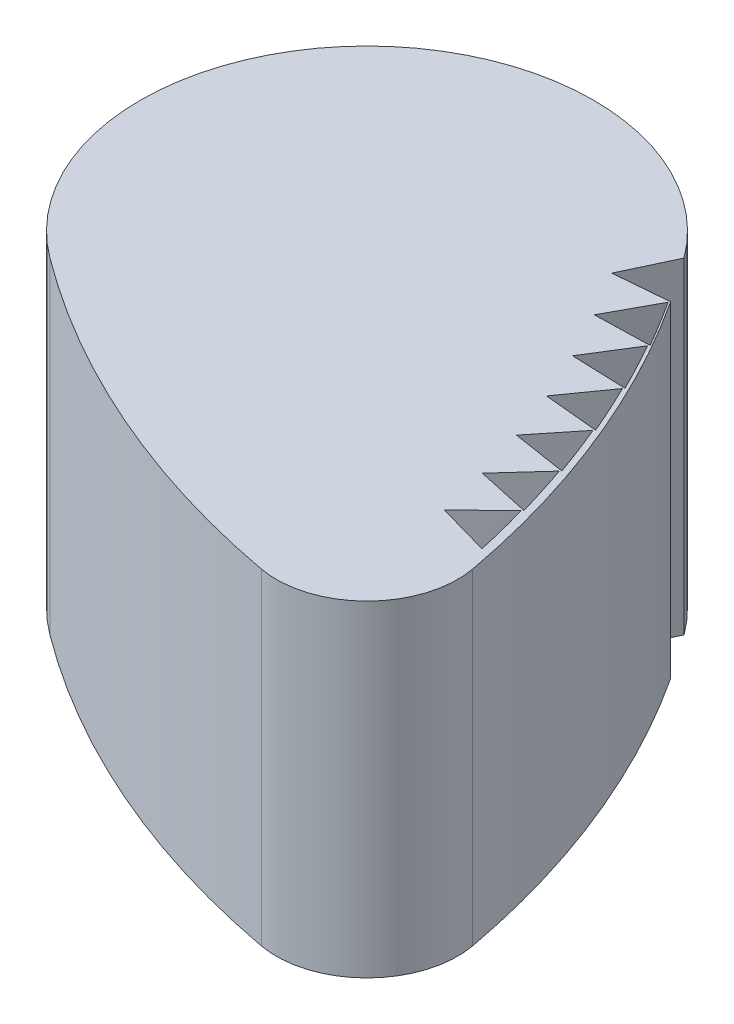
ISO-10303-21;
HEADER;
FILE_DESCRIPTION(('STEP AP214'),'2;1');
FILE_NAME('part.step','',(''),(''),'','','');
FILE_SCHEMA(('AUTOMOTIVE_DESIGN { 1 0 10303 214 1 1 1 1 }'));
ENDSEC;
DATA;
#1=APPLICATION_CONTEXT('core data for automotive mechanical design processes');
#2=APPLICATION_PROTOCOL_DEFINITION('international standard','automotive_design',2000,#1);
#3=PRODUCT_CONTEXT('',#1,'mechanical');
#4=PRODUCT('Part','Part','',(#3));
#5=PRODUCT_RELATED_PRODUCT_CATEGORY('part','',(#4));
#6=PRODUCT_DEFINITION_FORMATION('','',#4);
#7=PRODUCT_DEFINITION_CONTEXT('part definition',#1,'design');
#8=PRODUCT_DEFINITION('design','',#6,#7);
#9=PRODUCT_DEFINITION_SHAPE('','',#8);
#10=(LENGTH_UNIT() NAMED_UNIT(*) SI_UNIT(.MILLI.,.METRE.));
#11=(NAMED_UNIT(*) PLANE_ANGLE_UNIT() SI_UNIT($,.RADIAN.));
#12=(NAMED_UNIT(*) SI_UNIT($,.STERADIAN.) SOLID_ANGLE_UNIT());
#13=UNCERTAINTY_MEASURE_WITH_UNIT(LENGTH_MEASURE(1.E-05),#10,'distance_accuracy_value','');
#14=(GEOMETRIC_REPRESENTATION_CONTEXT(3) GLOBAL_UNCERTAINTY_ASSIGNED_CONTEXT((#13)) GLOBAL_UNIT_ASSIGNED_CONTEXT((#10,
#11,#12)) REPRESENTATION_CONTEXT('',''));
#15=CARTESIAN_POINT('',(0.,0.,0.));
#16=DIRECTION('',(0.,0.,1.));
#17=DIRECTION('',(1.,0.,0.));
#18=AXIS2_PLACEMENT_3D('',#15,#16,#17);
#19=CARTESIAN_POINT('',(22.3660307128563,18.,-30.1000111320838));
#20=DIRECTION('',(0.,-1.,0.));
#21=DIRECTION('',(0.,0.,-1.));
#22=AXIS2_PLACEMENT_3D('',#19,#20,#21);
#23=CYLINDRICAL_SURFACE('',#22,50.);
#24=CARTESIAN_POINT('',(22.3660307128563,0.,-30.1000111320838));
#25=DIRECTION('',(0.,1.,0.));
#26=DIRECTION('',(0.,0.,1.));
#27=AXIS2_PLACEMENT_3D('',#24,#25,#26);
#28=CIRCLE('',#27,50.);
#29=CARTESIAN_POINT('',(-7.45534357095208,0.,10.0333370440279));
#30=VERTEX_POINT('',#29);
#31=CARTESIAN_POINT('',(13.2283695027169,0.,19.0579297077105));
#32=VERTEX_POINT('',#31);
#33=EDGE_CURVE('E358',#30,#32,#28,.T.);
#34=ORIENTED_EDGE('',*,*,#33,.T.);
#35=DIRECTION('',(0.,-1.,0.));
#36=VECTOR('',#35,1.);
#37=CARTESIAN_POINT('',(13.2283695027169,18.,19.0579297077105));
#38=LINE('',#37,#36);
#39=CARTESIAN_POINT('',(13.2283695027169,18.,19.0579297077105));
#40=VERTEX_POINT('',#39);
#41=EDGE_CURVE('E12',#40,#32,#38,.T.);
#42=ORIENTED_EDGE('',*,*,#41,.F.);
#43=CARTESIAN_POINT('',(22.3660307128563,18.,-30.1000111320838));
#44=DIRECTION('',(0.,1.,0.));
#45=DIRECTION('',(0.,0.,1.));
#46=AXIS2_PLACEMENT_3D('',#43,#44,#45);
#47=CIRCLE('',#46,50.);
#48=CARTESIAN_POINT('',(-7.45534357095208,18.,10.0333370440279));
#49=VERTEX_POINT('',#48);
#50=EDGE_CURVE('E360',#49,#40,#47,.T.);
#51=ORIENTED_EDGE('',*,*,#50,.F.);
#52=DIRECTION('',(0.,-1.,0.));
#53=VECTOR('',#52,1.);
#54=CARTESIAN_POINT('',(-7.45534357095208,18.,10.0333370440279));
#55=LINE('',#54,#53);
#56=EDGE_CURVE('E371',#49,#30,#55,.T.);
#57=ORIENTED_EDGE('',*,*,#56,.T.);
#58=EDGE_LOOP('',(#34,#42,#51,#57));
#59=FACE_BOUND('',#58,.T.);
#60=ADVANCED_FACE('F36',(#59),#23,.T.);
#61=CARTESIAN_POINT('',(14.1421356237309,18.,14.142135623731));
#62=DIRECTION('',(0.,-1.,0.));
#63=DIRECTION('',(0.,0.,-1.));
#64=AXIS2_PLACEMENT_3D('',#61,#62,#63);
#65=CYLINDRICAL_SURFACE('',#64,5.);
#66=CARTESIAN_POINT('',(14.1421356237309,0.,14.142135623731));
#67=DIRECTION('',(0.,1.,0.));
#68=DIRECTION('',(0.,0.,1.));
#69=AXIS2_PLACEMENT_3D('',#66,#67,#68);
#70=CIRCLE('',#69,5.);
#71=CARTESIAN_POINT('',(19.0579297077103,0.,13.2283695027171));
#72=VERTEX_POINT('',#71);
#73=EDGE_CURVE('E374',#32,#72,#70,.T.);
#74=ORIENTED_EDGE('',*,*,#73,.T.);
#75=DIRECTION('',(0.,-1.,0.));
#76=VECTOR('',#75,1.);
#77=CARTESIAN_POINT('',(19.0579297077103,18.,13.2283695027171));
#78=LINE('',#77,#76);
#79=CARTESIAN_POINT('',(19.0579297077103,18.,13.2283695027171));
#80=VERTEX_POINT('',#79);
#81=EDGE_CURVE('E43',#80,#72,#78,.T.);
#82=ORIENTED_EDGE('',*,*,#81,.F.);
#83=CARTESIAN_POINT('',(14.1421356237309,18.,14.142135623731));
#84=DIRECTION('',(0.,1.,0.));
#85=DIRECTION('',(0.,0.,1.));
#86=AXIS2_PLACEMENT_3D('',#83,#84,#85);
#87=CIRCLE('',#86,5.);
#88=EDGE_CURVE('E363',#40,#80,#87,.T.);
#89=ORIENTED_EDGE('',*,*,#88,.F.);
#90=ORIENTED_EDGE('',*,*,#41,.T.);
#91=EDGE_LOOP('',(#74,#82,#89,#90));
#92=FACE_BOUND('',#91,.T.);
#93=ADVANCED_FACE('F406',(#92),#65,.T.);
#94=CARTESIAN_POINT('',(-30.1000111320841,18.,22.3660307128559));
#95=DIRECTION('',(0.,-1.,0.));
#96=DIRECTION('',(0.,0.,-1.));
#97=AXIS2_PLACEMENT_3D('',#94,#95,#96);
#98=CYLINDRICAL_SURFACE('',#97,50.);
#99=CARTESIAN_POINT('',(-30.1000111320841,0.,22.3660307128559));
#100=DIRECTION('',(0.,1.,0.));
#101=DIRECTION('',(0.,0.,-1.));
#102=AXIS2_PLACEMENT_3D('',#99,#100,#101);
#103=CIRCLE('',#102,50.);
#104=CARTESIAN_POINT('',(11.7495741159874,0.,-4.99474805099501));
#105=VERTEX_POINT('',#104);
#106=EDGE_CURVE('E376',#72,#105,#103,.T.);
#107=ORIENTED_EDGE('',*,*,#106,.T.);
#108=DIRECTION('',(0.,1.,0.));
#109=VECTOR('',#108,1.);
#110=CARTESIAN_POINT('',(11.7495741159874,0.,-4.99474805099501));
#111=LINE('',#110,#109);
#112=CARTESIAN_POINT('',(11.7495741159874,18.,-4.99474805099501));
#113=VERTEX_POINT('',#112);
#114=EDGE_CURVE('E355',#105,#113,#111,.T.);
#115=ORIENTED_EDGE('',*,*,#114,.T.);
#116=CARTESIAN_POINT('',(-30.1000111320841,18.,22.3660307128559));
#117=DIRECTION('',(0.,1.,0.));
#118=DIRECTION('',(0.,0.,-1.));
#119=AXIS2_PLACEMENT_3D('',#116,#117,#118);
#120=CIRCLE('',#119,50.);
#121=EDGE_CURVE('E366',#80,#113,#120,.T.);
#122=ORIENTED_EDGE('',*,*,#121,.F.);
#123=ORIENTED_EDGE('',*,*,#81,.T.);
#124=EDGE_LOOP('',(#107,#115,#122,#123));
#125=FACE_BOUND('',#124,.T.);
#126=ADVANCED_FACE('F389',(#125),#98,.T.);
#127=CARTESIAN_POINT('',(0.,18.,0.));
#128=DIRECTION('',(0.,-1.,0.));
#129=DIRECTION('',(0.,0.,-1.));
#130=AXIS2_PLACEMENT_3D('',#127,#128,#129);
#131=CYLINDRICAL_SURFACE('',#130,12.5);
#132=CARTESIAN_POINT('',(0.,0.,0.));
#133=DIRECTION('',(0.,1.,0.));
#134=DIRECTION('',(0.,0.,1.));
#135=AXIS2_PLACEMENT_3D('',#132,#133,#134);
#136=CIRCLE('',#135,12.5);
#137=CARTESIAN_POINT('',(10.033337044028,0.,-7.45534357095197));
#138=VERTEX_POINT('',#137);
#139=EDGE_CURVE('E364',#138,#30,#136,.T.);
#140=ORIENTED_EDGE('',*,*,#139,.T.);
#141=ORIENTED_EDGE('',*,*,#56,.F.);
#142=CARTESIAN_POINT('',(0.,18.,0.));
#143=DIRECTION('',(0.,1.,0.));
#144=DIRECTION('',(0.,0.,1.));
#145=AXIS2_PLACEMENT_3D('',#142,#143,#144);
#146=CIRCLE('',#145,12.5);
#147=CARTESIAN_POINT('',(10.033337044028,18.,-7.45534357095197));
#148=VERTEX_POINT('',#147);
#149=EDGE_CURVE('E369',#148,#49,#146,.T.);
#150=ORIENTED_EDGE('',*,*,#149,.F.);
#151=DIRECTION('',(0.,-1.,0.));
#152=VECTOR('',#151,1.);
#153=CARTESIAN_POINT('',(10.033337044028,18.,-7.45534357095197));
#154=LINE('',#153,#152);
#155=EDGE_CURVE('E382',#148,#138,#154,.T.);
#156=ORIENTED_EDGE('',*,*,#155,.T.);
#157=EDGE_LOOP('',(#140,#141,#150,#156));
#158=FACE_BOUND('',#157,.T.);
#159=ADVANCED_FACE('F410',(#158),#131,.T.);
#160=CARTESIAN_POINT('',(18.2540831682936,18.,-7.97893775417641));
#161=DIRECTION('',(0.,1.,0.));
#162=DIRECTION('',(0.,0.,1.));
#163=AXIS2_PLACEMENT_3D('',#160,#161,#162);
#164=PLANE('',#163);
#165=CARTESIAN_POINT('',(-30.4609140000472,18.,22.8681883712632));
#166=DIRECTION('',(0.,1.,0.));
#167=DIRECTION('',(-0.352274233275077,0.,0.93589682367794));
#168=AXIS2_PLACEMENT_3D('',#165,#166,#167);
#169=CIRCLE('',#168,50.);
#170=CARTESIAN_POINT('',(18.3444772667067,18.,12.0038529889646));
#171=VERTEX_POINT('',#170);
#172=CARTESIAN_POINT('',(17.6050608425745,18.,9.096403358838));
#173=VERTEX_POINT('',#172);
#174=EDGE_CURVE('E50',#171,#173,#169,.T.);
#175=ORIENTED_EDGE('',*,*,#174,.F.);
#176=DIRECTION('',(0.962544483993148,0.,0.271123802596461));
#177=VECTOR('',#176,1.);
#178=CARTESIAN_POINT('',(15.4568438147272,18.,11.1904815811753));
#179=LINE('',#178,#177);
#180=CARTESIAN_POINT('',(15.4568438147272,18.,11.1904815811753));
#181=VERTEX_POINT('',#180);
#182=EDGE_CURVE('E211',#181,#171,#179,.T.);
#183=ORIENTED_EDGE('',*,*,#182,.F.);
#184=DIRECTION('',(-0.716072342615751,0.,0.698026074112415));
#185=VECTOR('',#184,1.);
#186=CARTESIAN_POINT('',(17.6050608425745,18.,9.09640335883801));
#187=LINE('',#186,#185);
#188=EDGE_CURVE('E214',#173,#181,#187,.T.);
#189=ORIENTED_EDGE('',*,*,#188,.F.);
#190=EDGE_LOOP('',(#175,#183,#189));
#191=FACE_BOUND('',#190,.T.);
#192=CARTESIAN_POINT('',(-30.3885527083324,18.,22.794035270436));
#193=DIRECTION('',(0.,1.,0.));
#194=DIRECTION('',(-0.295520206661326,0.,0.95533648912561));
#195=AXIS2_PLACEMENT_3D('',#192,#193,#194);
#196=CIRCLE('',#195,50.);
#197=CARTESIAN_POINT('',(17.6775461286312,18.,9.02268302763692));
#198=VERTEX_POINT('',#197);
#199=CARTESIAN_POINT('',(16.7651179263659,18.,6.16480360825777));
#200=VERTEX_POINT('',#199);
#201=EDGE_CURVE('E222',#198,#200,#196,.T.);
#202=ORIENTED_EDGE('',*,*,#201,.F.);
#203=DIRECTION('',(0.977070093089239,0.,0.212917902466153));
#204=VECTOR('',#203,1.);
#205=CARTESIAN_POINT('',(14.7463358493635,18.,8.38392932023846));
#206=LINE('',#205,#204);
#207=CARTESIAN_POINT('',(14.7463358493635,18.,8.38392932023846));
#208=VERTEX_POINT('',#207);
#209=EDGE_CURVE('E228',#208,#198,#206,.T.);
#210=ORIENTED_EDGE('',*,*,#209,.F.);
#211=DIRECTION('',(-0.67292735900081,0.,0.739708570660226));
#212=VECTOR('',#211,1.);
#213=CARTESIAN_POINT('',(16.7651179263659,18.,6.16480360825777));
#214=LINE('',#213,#212);
#215=EDGE_CURVE('E236',#200,#208,#214,.T.);
#216=ORIENTED_EDGE('',*,*,#215,.F.);
#217=EDGE_LOOP('',(#202,#210,#216));
#218=FACE_BOUND('',#217,.T.);
#219=CARTESIAN_POINT('',(-30.3207681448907,18.,22.7156765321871));
#220=DIRECTION('',(0.,1.,0.));
#221=DIRECTION('',(-0.237702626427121,0.,0.971337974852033));
#222=AXIS2_PLACEMENT_3D('',#219,#220,#221);
#223=CIRCLE('',#222,50.);
#224=CARTESIAN_POINT('',(16.8330522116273,18.,6.08686942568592));
#225=VERTEX_POINT('',#224);
#226=CARTESIAN_POINT('',(15.7508959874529,18.,3.2888454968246));
#227=VERTEX_POINT('',#226);
#228=EDGE_CURVE('E243',#225,#227,#223,.T.);
#229=ORIENTED_EDGE('',*,*,#228,.F.);
#230=DIRECTION('',(0.988079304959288,0.,0.153945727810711));
#231=VECTOR('',#230,1.);
#232=CARTESIAN_POINT('',(13.8688142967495,18.,5.62503224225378));
#233=LINE('',#232,#231);
#234=CARTESIAN_POINT('',(13.8688142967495,18.,5.62503224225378));
#235=VERTEX_POINT('',#234);
#236=EDGE_CURVE('E252',#235,#225,#233,.T.);
#237=ORIENTED_EDGE('',*,*,#236,.F.);
#238=DIRECTION('',(-0.62736056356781,0.,0.778728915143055));
#239=VECTOR('',#238,1.);
#240=CARTESIAN_POINT('',(15.7508959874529,18.,3.2888454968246));
#241=LINE('',#240,#239);
#242=EDGE_CURVE('E260',#227,#235,#241,.T.);
#243=ORIENTED_EDGE('',*,*,#242,.F.);
#244=EDGE_LOOP('',(#229,#237,#243));
#245=FACE_BOUND('',#244,.T.);
#246=CARTESIAN_POINT('',(-30.257804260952,18.,22.633394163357));
#247=DIRECTION('',(0.,1.,0.));
#248=DIRECTION('',(-0.17902957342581,0.,0.983843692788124));
#249=AXIS2_PLACEMENT_3D('',#246,#247,#248);
#250=CIRCLE('',#249,50.);
#251=CARTESIAN_POINT('',(15.8140347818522,18.,3.20697794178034));
#252=VERTEX_POINT('',#251);
#253=CARTESIAN_POINT('',(14.5660451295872,18.,0.478879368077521));
#254=VERTEX_POINT('',#253);
#255=EDGE_CURVE('E267',#252,#254,#250,.T.);
#256=ORIENTED_EDGE('',*,*,#255,.F.);
#257=DIRECTION('',(0.995532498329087,0.,0.0944195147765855));
#258=VECTOR('',#257,1.);
#259=CARTESIAN_POINT('',(12.8274372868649,18.,2.92371939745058));
#260=LINE('',#259,#258);
#261=CARTESIAN_POINT('',(12.8274372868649,18.,2.92371939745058));
#262=VERTEX_POINT('',#261);
#263=EDGE_CURVE('E276',#262,#252,#260,.T.);
#264=ORIENTED_EDGE('',*,*,#263,.F.);
#265=DIRECTION('',(-0.579535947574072,0.,0.814946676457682));
#266=VECTOR('',#265,1.);
#267=CARTESIAN_POINT('',(14.5660451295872,18.,0.478879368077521));
#268=LINE('',#267,#266);
#269=EDGE_CURVE('E284',#254,#262,#268,.T.);
#270=ORIENTED_EDGE('',*,*,#269,.F.);
#271=EDGE_LOOP('',(#256,#264,#270));
#272=FACE_BOUND('',#271,.T.);
#273=CARTESIAN_POINT('',(-30.1998876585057,18.,22.5474842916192));
#274=DIRECTION('',(0.,1.,0.));
#275=DIRECTION('',(-0.119712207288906,0.,0.992808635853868));
#276=AXIS2_PLACEMENT_3D('',#273,#274,#275);
#277=CIRCLE('',#276,50.);
#278=CARTESIAN_POINT('',(14.6241612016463,18.,0.393373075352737));
#279=VERTEX_POINT('',#278);
#280=CARTESIAN_POINT('',(13.2148295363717,18.,-2.25498193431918));
#281=VERTEX_POINT('',#280);
#282=EDGE_CURVE('E291',#279,#281,#277,.T.);
#283=ORIENTED_EDGE('',*,*,#282,.F.);
#284=DIRECTION('',(0.999402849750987,0.,0.034553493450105));
#285=VECTOR('',#284,1.);
#286=CARTESIAN_POINT('',(11.6259526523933,18.,0.289712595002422));
#287=LINE('',#286,#285);
#288=CARTESIAN_POINT('',(11.6259526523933,18.,0.289712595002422));
#289=VERTEX_POINT('',#288);
#290=EDGE_CURVE('E300',#289,#279,#287,.T.);
#291=ORIENTED_EDGE('',*,*,#290,.F.);
#292=DIRECTION('',(-0.529625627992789,0.,0.848231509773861));
#293=VECTOR('',#292,1.);
#294=CARTESIAN_POINT('',(13.2148295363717,18.,-2.25498193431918));
#295=LINE('',#294,#293);
#296=EDGE_CURVE('E308',#281,#289,#295,.T.);
#297=ORIENTED_EDGE('',*,*,#296,.F.);
#298=EDGE_LOOP('',(#283,#291,#297));
#299=FACE_BOUND('',#298,.T.);
#300=CARTESIAN_POINT('',(-30.1472267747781,18.,22.4582560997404));
#301=DIRECTION('',(0.,1.,0.));
#302=DIRECTION('',(-0.0599640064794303,0.,0.998200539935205));
#303=AXIS2_PLACEMENT_3D('',#300,#301,#302);
#304=CIRCLE('',#303,50.);
#305=CARTESIAN_POINT('',(13.2677137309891,18.,-2.34381923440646));
#306=VERTEX_POINT('',#305);
#307=CARTESIAN_POINT('',(11.7021121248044,18.,-4.90289946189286));
#308=VERTEX_POINT('',#307);
#309=EDGE_CURVE('E315',#306,#308,#304,.T.);
#310=ORIENTED_EDGE('',*,*,#309,.F.);
#311=DIRECTION('',(0.999676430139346,0.,-0.0254368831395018));
#312=VECTOR('',#311,1.);
#313=CARTESIAN_POINT('',(10.268684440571,18.,-2.26750858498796));
#314=LINE('',#313,#312);
#315=CARTESIAN_POINT('',(10.268684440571,18.,-2.26750858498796));
#316=VERTEX_POINT('',#315);
#317=EDGE_CURVE('E324',#316,#306,#314,.T.);
#318=ORIENTED_EDGE('',*,*,#317,.F.);
#319=DIRECTION('',(-0.477809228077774,0.,0.878463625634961));
#320=VECTOR('',#319,1.);
#321=CARTESIAN_POINT('',(11.7021121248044,18.,-4.90289946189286));
#322=LINE('',#321,#320);
#323=EDGE_CURVE('E332',#308,#316,#322,.T.);
#324=ORIENTED_EDGE('',*,*,#323,.F.);
#325=EDGE_LOOP('',(#310,#318,#324));
#326=FACE_BOUND('',#325,.T.);
#327=DIRECTION('',(0.9963522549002,0.,-0.0853357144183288));
#328=VECTOR('',#327,1.);
#329=CARTESIAN_POINT('',(8.76051735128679,18.,-4.73874090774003));
#330=LINE('',#329,#328);
#331=CARTESIAN_POINT('',(8.76051735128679,18.,-4.73874090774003));
#332=VERTEX_POINT('',#331);
#333=EDGE_CURVE('E348',#332,#113,#330,.T.);
#334=ORIENTED_EDGE('',*,*,#333,.F.);
#335=DIRECTION('',(-0.424273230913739,0.,0.905534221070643));
#336=VECTOR('',#335,1.);
#337=CARTESIAN_POINT('',(10.033337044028,18.,-7.45534357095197));
#338=LINE('',#337,#336);
#339=EDGE_CURVE('E339',#148,#332,#338,.T.);
#340=ORIENTED_EDGE('',*,*,#339,.F.);
#341=ORIENTED_EDGE('',*,*,#149,.T.);
#342=ORIENTED_EDGE('',*,*,#50,.T.);
#343=ORIENTED_EDGE('',*,*,#88,.T.);
#344=ORIENTED_EDGE('',*,*,#121,.T.);
#345=EDGE_LOOP('',(#334,#340,#341,#342,#343,#344));
#346=FACE_BOUND('',#345,.T.);
#347=ADVANCED_FACE('F403',(#191,#218,#245,#272,#299,#326,#346),#164,.T.);
#348=CARTESIAN_POINT('',(18.2540831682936,0.,-7.97893775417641));
#349=DIRECTION('',(0.,1.,0.));
#350=DIRECTION('',(0.,0.,1.));
#351=AXIS2_PLACEMENT_3D('',#348,#349,#350);
#352=PLANE('',#351);
#353=DIRECTION('',(0.962544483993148,0.,0.271123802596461));
#354=VECTOR('',#353,1.);
#355=CARTESIAN_POINT('',(15.4568438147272,0.,11.1904815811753));
#356=LINE('',#355,#354);
#357=CARTESIAN_POINT('',(15.4568438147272,0.,11.1904815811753));
#358=VERTEX_POINT('',#357);
#359=CARTESIAN_POINT('',(18.3444772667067,0.,12.0038529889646));
#360=VERTEX_POINT('',#359);
#361=EDGE_CURVE('E58',#358,#360,#356,.T.);
#362=ORIENTED_EDGE('',*,*,#361,.T.);
#363=CARTESIAN_POINT('',(-30.4609140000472,0.,22.8681883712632));
#364=DIRECTION('',(0.,1.,0.));
#365=DIRECTION('',(-0.352274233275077,0.,0.93589682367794));
#366=AXIS2_PLACEMENT_3D('',#363,#364,#365);
#367=CIRCLE('',#366,50.);
#368=CARTESIAN_POINT('',(17.6050608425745,0.,9.09640335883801));
#369=VERTEX_POINT('',#368);
#370=EDGE_CURVE('E198',#360,#369,#367,.T.);
#371=ORIENTED_EDGE('',*,*,#370,.T.);
#372=DIRECTION('',(-0.716072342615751,0.,0.698026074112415));
#373=VECTOR('',#372,1.);
#374=CARTESIAN_POINT('',(17.6050608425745,0.,9.09640335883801));
#375=LINE('',#374,#373);
#376=EDGE_CURVE('E205',#369,#358,#375,.T.);
#377=ORIENTED_EDGE('',*,*,#376,.T.);
#378=EDGE_LOOP('',(#362,#371,#377));
#379=FACE_BOUND('',#378,.T.);
#380=DIRECTION('',(0.977070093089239,0.,0.212917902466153));
#381=VECTOR('',#380,1.);
#382=CARTESIAN_POINT('',(14.7463358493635,0.,8.38392932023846));
#383=LINE('',#382,#381);
#384=CARTESIAN_POINT('',(14.7463358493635,0.,8.38392932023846));
#385=VERTEX_POINT('',#384);
#386=CARTESIAN_POINT('',(17.6775461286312,0.,9.02268302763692));
#387=VERTEX_POINT('',#386);
#388=EDGE_CURVE('E231',#385,#387,#383,.T.);
#389=ORIENTED_EDGE('',*,*,#388,.T.);
#390=CARTESIAN_POINT('',(-30.3885527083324,0.,22.794035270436));
#391=DIRECTION('',(0.,1.,0.));
#392=DIRECTION('',(-0.295520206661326,0.,0.95533648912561));
#393=AXIS2_PLACEMENT_3D('',#390,#391,#392);
#394=CIRCLE('',#393,50.);
#395=CARTESIAN_POINT('',(16.7651179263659,0.,6.16480360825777));
#396=VERTEX_POINT('',#395);
#397=EDGE_CURVE('E224',#387,#396,#394,.T.);
#398=ORIENTED_EDGE('',*,*,#397,.T.);
#399=DIRECTION('',(-0.67292735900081,0.,0.739708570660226));
#400=VECTOR('',#399,1.);
#401=CARTESIAN_POINT('',(16.7651179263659,0.,6.16480360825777));
#402=LINE('',#401,#400);
#403=EDGE_CURVE('E227',#396,#385,#402,.T.);
#404=ORIENTED_EDGE('',*,*,#403,.T.);
#405=EDGE_LOOP('',(#389,#398,#404));
#406=FACE_BOUND('',#405,.T.);
#407=DIRECTION('',(0.988079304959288,0.,0.153945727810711));
#408=VECTOR('',#407,1.);
#409=CARTESIAN_POINT('',(13.8688142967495,0.,5.62503224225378));
#410=LINE('',#409,#408);
#411=CARTESIAN_POINT('',(13.8688142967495,0.,5.62503224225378));
#412=VERTEX_POINT('',#411);
#413=CARTESIAN_POINT('',(16.8330522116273,0.,6.08686942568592));
#414=VERTEX_POINT('',#413);
#415=EDGE_CURVE('E255',#412,#414,#410,.T.);
#416=ORIENTED_EDGE('',*,*,#415,.T.);
#417=CARTESIAN_POINT('',(-30.3207681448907,0.,22.7156765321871));
#418=DIRECTION('',(0.,1.,0.));
#419=DIRECTION('',(-0.237702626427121,0.,0.971337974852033));
#420=AXIS2_PLACEMENT_3D('',#417,#418,#419);
#421=CIRCLE('',#420,50.);
#422=CARTESIAN_POINT('',(15.7508959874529,0.,3.2888454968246));
#423=VERTEX_POINT('',#422);
#424=EDGE_CURVE('E248',#414,#423,#421,.T.);
#425=ORIENTED_EDGE('',*,*,#424,.T.);
#426=DIRECTION('',(-0.62736056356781,0.,0.778728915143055));
#427=VECTOR('',#426,1.);
#428=CARTESIAN_POINT('',(15.7508959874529,0.,3.2888454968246));
#429=LINE('',#428,#427);
#430=EDGE_CURVE('E251',#423,#412,#429,.T.);
#431=ORIENTED_EDGE('',*,*,#430,.T.);
#432=EDGE_LOOP('',(#416,#425,#431));
#433=FACE_BOUND('',#432,.T.);
#434=DIRECTION('',(0.995532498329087,0.,0.0944195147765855));
#435=VECTOR('',#434,1.);
#436=CARTESIAN_POINT('',(12.8274372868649,0.,2.92371939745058));
#437=LINE('',#436,#435);
#438=CARTESIAN_POINT('',(12.8274372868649,0.,2.92371939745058));
#439=VERTEX_POINT('',#438);
#440=CARTESIAN_POINT('',(15.8140347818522,0.,3.20697794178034));
#441=VERTEX_POINT('',#440);
#442=EDGE_CURVE('E279',#439,#441,#437,.T.);
#443=ORIENTED_EDGE('',*,*,#442,.T.);
#444=CARTESIAN_POINT('',(-30.257804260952,0.,22.633394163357));
#445=DIRECTION('',(0.,1.,0.));
#446=DIRECTION('',(-0.17902957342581,0.,0.983843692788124));
#447=AXIS2_PLACEMENT_3D('',#444,#445,#446);
#448=CIRCLE('',#447,50.);
#449=CARTESIAN_POINT('',(14.5660451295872,0.,0.478879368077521));
#450=VERTEX_POINT('',#449);
#451=EDGE_CURVE('E272',#441,#450,#448,.T.);
#452=ORIENTED_EDGE('',*,*,#451,.T.);
#453=DIRECTION('',(-0.579535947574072,0.,0.814946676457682));
#454=VECTOR('',#453,1.);
#455=CARTESIAN_POINT('',(14.5660451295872,0.,0.478879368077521));
#456=LINE('',#455,#454);
#457=EDGE_CURVE('E275',#450,#439,#456,.T.);
#458=ORIENTED_EDGE('',*,*,#457,.T.);
#459=EDGE_LOOP('',(#443,#452,#458));
#460=FACE_BOUND('',#459,.T.);
#461=DIRECTION('',(0.999402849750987,0.,0.034553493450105));
#462=VECTOR('',#461,1.);
#463=CARTESIAN_POINT('',(11.6259526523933,0.,0.289712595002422));
#464=LINE('',#463,#462);
#465=CARTESIAN_POINT('',(11.6259526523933,0.,0.289712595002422));
#466=VERTEX_POINT('',#465);
#467=CARTESIAN_POINT('',(14.6241612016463,0.,0.393373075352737));
#468=VERTEX_POINT('',#467);
#469=EDGE_CURVE('E303',#466,#468,#464,.T.);
#470=ORIENTED_EDGE('',*,*,#469,.T.);
#471=CARTESIAN_POINT('',(-30.1998876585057,0.,22.5474842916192));
#472=DIRECTION('',(0.,1.,0.));
#473=DIRECTION('',(-0.119712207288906,0.,0.992808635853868));
#474=AXIS2_PLACEMENT_3D('',#471,#472,#473);
#475=CIRCLE('',#474,50.);
#476=CARTESIAN_POINT('',(13.2148295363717,0.,-2.25498193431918));
#477=VERTEX_POINT('',#476);
#478=EDGE_CURVE('E296',#468,#477,#475,.T.);
#479=ORIENTED_EDGE('',*,*,#478,.T.);
#480=DIRECTION('',(-0.529625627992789,0.,0.848231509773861));
#481=VECTOR('',#480,1.);
#482=CARTESIAN_POINT('',(13.2148295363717,0.,-2.25498193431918));
#483=LINE('',#482,#481);
#484=EDGE_CURVE('E299',#477,#466,#483,.T.);
#485=ORIENTED_EDGE('',*,*,#484,.T.);
#486=EDGE_LOOP('',(#470,#479,#485));
#487=FACE_BOUND('',#486,.T.);
#488=DIRECTION('',(0.999676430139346,0.,-0.0254368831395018));
#489=VECTOR('',#488,1.);
#490=CARTESIAN_POINT('',(10.268684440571,0.,-2.26750858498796));
#491=LINE('',#490,#489);
#492=CARTESIAN_POINT('',(10.268684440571,0.,-2.26750858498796));
#493=VERTEX_POINT('',#492);
#494=CARTESIAN_POINT('',(13.2677137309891,0.,-2.34381923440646));
#495=VERTEX_POINT('',#494);
#496=EDGE_CURVE('E327',#493,#495,#491,.T.);
#497=ORIENTED_EDGE('',*,*,#496,.T.);
#498=CARTESIAN_POINT('',(-30.1472267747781,0.,22.4582560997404));
#499=DIRECTION('',(0.,1.,0.));
#500=DIRECTION('',(-0.0599640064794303,0.,0.998200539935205));
#501=AXIS2_PLACEMENT_3D('',#498,#499,#500);
#502=CIRCLE('',#501,50.);
#503=CARTESIAN_POINT('',(11.7021121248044,0.,-4.90289946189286));
#504=VERTEX_POINT('',#503);
#505=EDGE_CURVE('E320',#495,#504,#502,.T.);
#506=ORIENTED_EDGE('',*,*,#505,.T.);
#507=DIRECTION('',(-0.477809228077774,0.,0.878463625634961));
#508=VECTOR('',#507,1.);
#509=CARTESIAN_POINT('',(11.7021121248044,0.,-4.90289946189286));
#510=LINE('',#509,#508);
#511=EDGE_CURVE('E323',#504,#493,#510,.T.);
#512=ORIENTED_EDGE('',*,*,#511,.T.);
#513=EDGE_LOOP('',(#497,#506,#512));
#514=FACE_BOUND('',#513,.T.);
#515=DIRECTION('',(-0.424273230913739,0.,0.905534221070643));
#516=VECTOR('',#515,1.);
#517=CARTESIAN_POINT('',(10.033337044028,0.,-7.45534357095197));
#518=LINE('',#517,#516);
#519=CARTESIAN_POINT('',(8.76051735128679,0.,-4.73874090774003));
#520=VERTEX_POINT('',#519);
#521=EDGE_CURVE('E344',#138,#520,#518,.T.);
#522=ORIENTED_EDGE('',*,*,#521,.T.);
#523=DIRECTION('',(0.9963522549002,0.,-0.0853357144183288));
#524=VECTOR('',#523,1.);
#525=CARTESIAN_POINT('',(8.76051735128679,0.,-4.73874090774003));
#526=LINE('',#525,#524);
#527=EDGE_CURVE('E347',#520,#105,#526,.T.);
#528=ORIENTED_EDGE('',*,*,#527,.T.);
#529=ORIENTED_EDGE('',*,*,#106,.F.);
#530=ORIENTED_EDGE('',*,*,#73,.F.);
#531=ORIENTED_EDGE('',*,*,#33,.F.);
#532=ORIENTED_EDGE('',*,*,#139,.F.);
#533=EDGE_LOOP('',(#522,#528,#529,#530,#531,#532));
#534=FACE_BOUND('',#533,.T.);
#535=ADVANCED_FACE('F209',(#379,#406,#433,#460,#487,#514,#534),#352,.F.);
#536=CARTESIAN_POINT('',(8.76051735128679,0.,-4.73874090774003));
#537=DIRECTION('',(0.0853357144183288,0.,0.9963522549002));
#538=DIRECTION('',(0.9963522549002,0.,-0.0853357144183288));
#539=AXIS2_PLACEMENT_3D('',#536,#537,#538);
#540=PLANE('',#539);
#541=ORIENTED_EDGE('',*,*,#333,.T.);
#542=ORIENTED_EDGE('',*,*,#114,.F.);
#543=ORIENTED_EDGE('',*,*,#527,.F.);
#544=DIRECTION('',(0.,1.,0.));
#545=VECTOR('',#544,1.);
#546=CARTESIAN_POINT('',(8.76051735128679,0.,-4.73874090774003));
#547=LINE('',#546,#545);
#548=EDGE_CURVE('E351',#520,#332,#547,.T.);
#549=ORIENTED_EDGE('',*,*,#548,.T.);
#550=EDGE_LOOP('',(#541,#542,#543,#549));
#551=FACE_BOUND('',#550,.T.);
#552=ADVANCED_FACE('F396',(#551),#540,.F.);
#553=CARTESIAN_POINT('',(10.033337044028,0.,-7.45534357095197));
#554=DIRECTION('',(-0.905534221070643,0.,-0.424273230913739));
#555=DIRECTION('',(-0.424273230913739,0.,0.905534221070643));
#556=AXIS2_PLACEMENT_3D('',#553,#554,#555);
#557=PLANE('',#556);
#558=ORIENTED_EDGE('',*,*,#339,.T.);
#559=ORIENTED_EDGE('',*,*,#548,.F.);
#560=ORIENTED_EDGE('',*,*,#521,.F.);
#561=ORIENTED_EDGE('',*,*,#155,.F.);
#562=EDGE_LOOP('',(#558,#559,#560,#561));
#563=FACE_BOUND('',#562,.T.);
#564=ADVANCED_FACE('F398',(#563),#557,.F.);
#565=CARTESIAN_POINT('',(-30.1472267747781,0.,22.4582560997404));
#566=DIRECTION('',(0.,1.,0.));
#567=DIRECTION('',(0.,0.,1.));
#568=AXIS2_PLACEMENT_3D('',#565,#566,#567);
#569=CYLINDRICAL_SURFACE('',#568,50.);
#570=ORIENTED_EDGE('',*,*,#309,.T.);
#571=DIRECTION('',(0.,1.,0.));
#572=VECTOR('',#571,1.);
#573=CARTESIAN_POINT('',(11.7021121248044,0.,-4.90289946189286));
#574=LINE('',#573,#572);
#575=EDGE_CURVE('E330',#504,#308,#574,.T.);
#576=ORIENTED_EDGE('',*,*,#575,.F.);
#577=ORIENTED_EDGE('',*,*,#505,.F.);
#578=DIRECTION('',(0.,1.,0.));
#579=VECTOR('',#578,1.);
#580=CARTESIAN_POINT('',(13.2677137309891,0.,-2.34381923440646));
#581=LINE('',#580,#579);
#582=EDGE_CURVE('E337',#495,#306,#581,.T.);
#583=ORIENTED_EDGE('',*,*,#582,.T.);
#584=EDGE_LOOP('',(#570,#576,#577,#583));
#585=FACE_BOUND('',#584,.T.);
#586=ADVANCED_FACE('F455',(#585),#569,.F.);
#587=CARTESIAN_POINT('',(10.268684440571,0.,-2.26750858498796));
#588=DIRECTION('',(0.0254368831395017,0.,0.999676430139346));
#589=DIRECTION('',(0.999676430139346,0.,-0.0254368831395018));
#590=AXIS2_PLACEMENT_3D('',#587,#588,#589);
#591=PLANE('',#590);
#592=ORIENTED_EDGE('',*,*,#317,.T.);
#593=ORIENTED_EDGE('',*,*,#582,.F.);
#594=ORIENTED_EDGE('',*,*,#496,.F.);
#595=DIRECTION('',(0.,1.,0.));
#596=VECTOR('',#595,1.);
#597=CARTESIAN_POINT('',(10.268684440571,0.,-2.26750858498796));
#598=LINE('',#597,#596);
#599=EDGE_CURVE('E340',#493,#316,#598,.T.);
#600=ORIENTED_EDGE('',*,*,#599,.T.);
#601=EDGE_LOOP('',(#592,#593,#594,#600));
#602=FACE_BOUND('',#601,.T.);
#603=ADVANCED_FACE('F470',(#602),#591,.F.);
#604=CARTESIAN_POINT('',(11.7021121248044,0.,-4.90289946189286));
#605=DIRECTION('',(-0.878463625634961,0.,-0.477809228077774));
#606=DIRECTION('',(-0.477809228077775,0.,0.878463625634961));
#607=AXIS2_PLACEMENT_3D('',#604,#605,#606);
#608=PLANE('',#607);
#609=ORIENTED_EDGE('',*,*,#323,.T.);
#610=ORIENTED_EDGE('',*,*,#599,.F.);
#611=ORIENTED_EDGE('',*,*,#511,.F.);
#612=ORIENTED_EDGE('',*,*,#575,.T.);
#613=EDGE_LOOP('',(#609,#610,#611,#612));
#614=FACE_BOUND('',#613,.T.);
#615=ADVANCED_FACE('F480',(#614),#608,.F.);
#616=CARTESIAN_POINT('',(-30.1998876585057,0.,22.5474842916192));
#617=DIRECTION('',(0.,1.,0.));
#618=DIRECTION('',(0.,0.,1.));
#619=AXIS2_PLACEMENT_3D('',#616,#617,#618);
#620=CYLINDRICAL_SURFACE('',#619,50.);
#621=ORIENTED_EDGE('',*,*,#282,.T.);
#622=DIRECTION('',(0.,1.,0.));
#623=VECTOR('',#622,1.);
#624=CARTESIAN_POINT('',(13.2148295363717,0.,-2.25498193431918));
#625=LINE('',#624,#623);
#626=EDGE_CURVE('E306',#477,#281,#625,.T.);
#627=ORIENTED_EDGE('',*,*,#626,.F.);
#628=ORIENTED_EDGE('',*,*,#478,.F.);
#629=DIRECTION('',(0.,1.,0.));
#630=VECTOR('',#629,1.);
#631=CARTESIAN_POINT('',(14.6241612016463,0.,0.393373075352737));
#632=LINE('',#631,#630);
#633=EDGE_CURVE('E313',#468,#279,#632,.T.);
#634=ORIENTED_EDGE('',*,*,#633,.T.);
#635=EDGE_LOOP('',(#621,#627,#628,#634));
#636=FACE_BOUND('',#635,.T.);
#637=ADVANCED_FACE('F490',(#636),#620,.F.);
#638=CARTESIAN_POINT('',(11.6259526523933,0.,0.289712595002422));
#639=DIRECTION('',(-0.034553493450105,0.,0.999402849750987));
#640=DIRECTION('',(0.999402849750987,0.,0.034553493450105));
#641=AXIS2_PLACEMENT_3D('',#638,#639,#640);
#642=PLANE('',#641);
#643=ORIENTED_EDGE('',*,*,#290,.T.);
#644=ORIENTED_EDGE('',*,*,#633,.F.);
#645=ORIENTED_EDGE('',*,*,#469,.F.);
#646=DIRECTION('',(0.,1.,0.));
#647=VECTOR('',#646,1.);
#648=CARTESIAN_POINT('',(11.6259526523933,0.,0.289712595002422));
#649=LINE('',#648,#647);
#650=EDGE_CURVE('E316',#466,#289,#649,.T.);
#651=ORIENTED_EDGE('',*,*,#650,.T.);
#652=EDGE_LOOP('',(#643,#644,#645,#651));
#653=FACE_BOUND('',#652,.T.);
#654=ADVANCED_FACE('F500',(#653),#642,.F.);
#655=CARTESIAN_POINT('',(13.2148295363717,0.,-2.25498193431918));
#656=DIRECTION('',(-0.848231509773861,0.,-0.529625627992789));
#657=DIRECTION('',(-0.529625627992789,0.,0.848231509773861));
#658=AXIS2_PLACEMENT_3D('',#655,#656,#657);
#659=PLANE('',#658);
#660=ORIENTED_EDGE('',*,*,#296,.T.);
#661=ORIENTED_EDGE('',*,*,#650,.F.);
#662=ORIENTED_EDGE('',*,*,#484,.F.);
#663=ORIENTED_EDGE('',*,*,#626,.T.);
#664=EDGE_LOOP('',(#660,#661,#662,#663));
#665=FACE_BOUND('',#664,.T.);
#666=ADVANCED_FACE('F510',(#665),#659,.F.);
#667=CARTESIAN_POINT('',(-30.257804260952,0.,22.633394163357));
#668=DIRECTION('',(0.,1.,0.));
#669=DIRECTION('',(0.,0.,1.));
#670=AXIS2_PLACEMENT_3D('',#667,#668,#669);
#671=CYLINDRICAL_SURFACE('',#670,50.);
#672=ORIENTED_EDGE('',*,*,#255,.T.);
#673=DIRECTION('',(0.,1.,0.));
#674=VECTOR('',#673,1.);
#675=CARTESIAN_POINT('',(14.5660451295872,0.,0.478879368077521));
#676=LINE('',#675,#674);
#677=EDGE_CURVE('E282',#450,#254,#676,.T.);
#678=ORIENTED_EDGE('',*,*,#677,.F.);
#679=ORIENTED_EDGE('',*,*,#451,.F.);
#680=DIRECTION('',(0.,1.,0.));
#681=VECTOR('',#680,1.);
#682=CARTESIAN_POINT('',(15.8140347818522,0.,3.20697794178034));
#683=LINE('',#682,#681);
#684=EDGE_CURVE('E289',#441,#252,#683,.T.);
#685=ORIENTED_EDGE('',*,*,#684,.T.);
#686=EDGE_LOOP('',(#672,#678,#679,#685));
#687=FACE_BOUND('',#686,.T.);
#688=ADVANCED_FACE('F520',(#687),#671,.F.);
#689=CARTESIAN_POINT('',(12.8274372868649,0.,2.92371939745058));
#690=DIRECTION('',(-0.0944195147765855,0.,0.995532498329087));
#691=DIRECTION('',(0.995532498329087,0.,0.0944195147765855));
#692=AXIS2_PLACEMENT_3D('',#689,#690,#691);
#693=PLANE('',#692);
#694=ORIENTED_EDGE('',*,*,#263,.T.);
#695=ORIENTED_EDGE('',*,*,#684,.F.);
#696=ORIENTED_EDGE('',*,*,#442,.F.);
#697=DIRECTION('',(0.,1.,0.));
#698=VECTOR('',#697,1.);
#699=CARTESIAN_POINT('',(12.8274372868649,0.,2.92371939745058));
#700=LINE('',#699,#698);
#701=EDGE_CURVE('E292',#439,#262,#700,.T.);
#702=ORIENTED_EDGE('',*,*,#701,.T.);
#703=EDGE_LOOP('',(#694,#695,#696,#702));
#704=FACE_BOUND('',#703,.T.);
#705=ADVANCED_FACE('F530',(#704),#693,.F.);
#706=CARTESIAN_POINT('',(14.5660451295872,0.,0.478879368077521));
#707=DIRECTION('',(-0.814946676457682,0.,-0.579535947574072));
#708=DIRECTION('',(-0.579535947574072,0.,0.814946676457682));
#709=AXIS2_PLACEMENT_3D('',#706,#707,#708);
#710=PLANE('',#709);
#711=ORIENTED_EDGE('',*,*,#269,.T.);
#712=ORIENTED_EDGE('',*,*,#701,.F.);
#713=ORIENTED_EDGE('',*,*,#457,.F.);
#714=ORIENTED_EDGE('',*,*,#677,.T.);
#715=EDGE_LOOP('',(#711,#712,#713,#714));
#716=FACE_BOUND('',#715,.T.);
#717=ADVANCED_FACE('F540',(#716),#710,.F.);
#718=CARTESIAN_POINT('',(-30.3207681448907,0.,22.7156765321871));
#719=DIRECTION('',(0.,1.,0.));
#720=DIRECTION('',(0.,0.,1.));
#721=AXIS2_PLACEMENT_3D('',#718,#719,#720);
#722=CYLINDRICAL_SURFACE('',#721,50.);
#723=ORIENTED_EDGE('',*,*,#228,.T.);
#724=DIRECTION('',(0.,1.,0.));
#725=VECTOR('',#724,1.);
#726=CARTESIAN_POINT('',(15.7508959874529,0.,3.2888454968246));
#727=LINE('',#726,#725);
#728=EDGE_CURVE('E258',#423,#227,#727,.T.);
#729=ORIENTED_EDGE('',*,*,#728,.F.);
#730=ORIENTED_EDGE('',*,*,#424,.F.);
#731=DIRECTION('',(0.,1.,0.));
#732=VECTOR('',#731,1.);
#733=CARTESIAN_POINT('',(16.8330522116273,0.,6.08686942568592));
#734=LINE('',#733,#732);
#735=EDGE_CURVE('E265',#414,#225,#734,.T.);
#736=ORIENTED_EDGE('',*,*,#735,.T.);
#737=EDGE_LOOP('',(#723,#729,#730,#736));
#738=FACE_BOUND('',#737,.T.);
#739=ADVANCED_FACE('F550',(#738),#722,.F.);
#740=CARTESIAN_POINT('',(13.8688142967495,0.,5.62503224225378));
#741=DIRECTION('',(-0.153945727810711,0.,0.988079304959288));
#742=DIRECTION('',(0.988079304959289,0.,0.153945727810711));
#743=AXIS2_PLACEMENT_3D('',#740,#741,#742);
#744=PLANE('',#743);
#745=ORIENTED_EDGE('',*,*,#236,.T.);
#746=ORIENTED_EDGE('',*,*,#735,.F.);
#747=ORIENTED_EDGE('',*,*,#415,.F.);
#748=DIRECTION('',(0.,1.,0.));
#749=VECTOR('',#748,1.);
#750=CARTESIAN_POINT('',(13.8688142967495,0.,5.62503224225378));
#751=LINE('',#750,#749);
#752=EDGE_CURVE('E268',#412,#235,#751,.T.);
#753=ORIENTED_EDGE('',*,*,#752,.T.);
#754=EDGE_LOOP('',(#745,#746,#747,#753));
#755=FACE_BOUND('',#754,.T.);
#756=ADVANCED_FACE('F560',(#755),#744,.F.);
#757=CARTESIAN_POINT('',(15.7508959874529,0.,3.2888454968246));
#758=DIRECTION('',(-0.778728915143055,0.,-0.62736056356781));
#759=DIRECTION('',(-0.62736056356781,0.,0.778728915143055));
#760=AXIS2_PLACEMENT_3D('',#757,#758,#759);
#761=PLANE('',#760);
#762=ORIENTED_EDGE('',*,*,#242,.T.);
#763=ORIENTED_EDGE('',*,*,#752,.F.);
#764=ORIENTED_EDGE('',*,*,#430,.F.);
#765=ORIENTED_EDGE('',*,*,#728,.T.);
#766=EDGE_LOOP('',(#762,#763,#764,#765));
#767=FACE_BOUND('',#766,.T.);
#768=ADVANCED_FACE('F570',(#767),#761,.F.);
#769=CARTESIAN_POINT('',(-30.3885527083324,0.,22.794035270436));
#770=DIRECTION('',(0.,1.,0.));
#771=DIRECTION('',(0.,0.,1.));
#772=AXIS2_PLACEMENT_3D('',#769,#770,#771);
#773=CYLINDRICAL_SURFACE('',#772,50.);
#774=ORIENTED_EDGE('',*,*,#201,.T.);
#775=DIRECTION('',(0.,1.,0.));
#776=VECTOR('',#775,1.);
#777=CARTESIAN_POINT('',(16.7651179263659,0.,6.16480360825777));
#778=LINE('',#777,#776);
#779=EDGE_CURVE('E234',#396,#200,#778,.T.);
#780=ORIENTED_EDGE('',*,*,#779,.F.);
#781=ORIENTED_EDGE('',*,*,#397,.F.);
#782=DIRECTION('',(0.,1.,0.));
#783=VECTOR('',#782,1.);
#784=CARTESIAN_POINT('',(17.6775461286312,0.,9.02268302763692));
#785=LINE('',#784,#783);
#786=EDGE_CURVE('E241',#387,#198,#785,.T.);
#787=ORIENTED_EDGE('',*,*,#786,.T.);
#788=EDGE_LOOP('',(#774,#780,#781,#787));
#789=FACE_BOUND('',#788,.T.);
#790=ADVANCED_FACE('F580',(#789),#773,.F.);
#791=CARTESIAN_POINT('',(14.7463358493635,0.,8.38392932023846));
#792=DIRECTION('',(-0.212917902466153,0.,0.977070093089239));
#793=DIRECTION('',(0.977070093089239,0.,0.212917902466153));
#794=AXIS2_PLACEMENT_3D('',#791,#792,#793);
#795=PLANE('',#794);
#796=ORIENTED_EDGE('',*,*,#209,.T.);
#797=ORIENTED_EDGE('',*,*,#786,.F.);
#798=ORIENTED_EDGE('',*,*,#388,.F.);
#799=DIRECTION('',(0.,1.,0.));
#800=VECTOR('',#799,1.);
#801=CARTESIAN_POINT('',(14.7463358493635,0.,8.38392932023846));
#802=LINE('',#801,#800);
#803=EDGE_CURVE('E244',#385,#208,#802,.T.);
#804=ORIENTED_EDGE('',*,*,#803,.T.);
#805=EDGE_LOOP('',(#796,#797,#798,#804));
#806=FACE_BOUND('',#805,.T.);
#807=ADVANCED_FACE('F590',(#806),#795,.F.);
#808=CARTESIAN_POINT('',(16.7651179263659,0.,6.16480360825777));
#809=DIRECTION('',(-0.739708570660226,0.,-0.672927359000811));
#810=DIRECTION('',(-0.672927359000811,0.,0.739708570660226));
#811=AXIS2_PLACEMENT_3D('',#808,#809,#810);
#812=PLANE('',#811);
#813=ORIENTED_EDGE('',*,*,#215,.T.);
#814=ORIENTED_EDGE('',*,*,#803,.F.);
#815=ORIENTED_EDGE('',*,*,#403,.F.);
#816=ORIENTED_EDGE('',*,*,#779,.T.);
#817=EDGE_LOOP('',(#813,#814,#815,#816));
#818=FACE_BOUND('',#817,.T.);
#819=ADVANCED_FACE('F600',(#818),#812,.F.);
#820=CARTESIAN_POINT('',(-30.4609140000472,0.,22.8681883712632));
#821=DIRECTION('',(0.,1.,0.));
#822=DIRECTION('',(0.,0.,1.));
#823=AXIS2_PLACEMENT_3D('',#820,#821,#822);
#824=CYLINDRICAL_SURFACE('',#823,50.);
#825=ORIENTED_EDGE('',*,*,#174,.T.);
#826=DIRECTION('',(0.,1.,0.));
#827=VECTOR('',#826,1.);
#828=CARTESIAN_POINT('',(17.6050608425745,0.,9.09640335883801));
#829=LINE('',#828,#827);
#830=EDGE_CURVE('E194',#369,#173,#829,.T.);
#831=ORIENTED_EDGE('',*,*,#830,.F.);
#832=ORIENTED_EDGE('',*,*,#370,.F.);
#833=DIRECTION('',(0.,1.,0.));
#834=VECTOR('',#833,1.);
#835=CARTESIAN_POINT('',(18.3444772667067,0.,12.0038529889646));
#836=LINE('',#835,#834);
#837=EDGE_CURVE('E220',#360,#171,#836,.T.);
#838=ORIENTED_EDGE('',*,*,#837,.T.);
#839=EDGE_LOOP('',(#825,#831,#832,#838));
#840=FACE_BOUND('',#839,.T.);
#841=ADVANCED_FACE('F196',(#840),#824,.F.);
#842=CARTESIAN_POINT('',(15.4568438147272,0.,11.1904815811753));
#843=DIRECTION('',(-0.271123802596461,0.,0.962544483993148));
#844=DIRECTION('',(0.962544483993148,0.,0.271123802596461));
#845=AXIS2_PLACEMENT_3D('',#842,#843,#844);
#846=PLANE('',#845);
#847=ORIENTED_EDGE('',*,*,#182,.T.);
#848=ORIENTED_EDGE('',*,*,#837,.F.);
#849=ORIENTED_EDGE('',*,*,#361,.F.);
#850=DIRECTION('',(0.,1.,0.));
#851=VECTOR('',#850,1.);
#852=CARTESIAN_POINT('',(15.4568438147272,0.,11.1904815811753));
#853=LINE('',#852,#851);
#854=EDGE_CURVE('E202',#358,#181,#853,.T.);
#855=ORIENTED_EDGE('',*,*,#854,.T.);
#856=EDGE_LOOP('',(#847,#848,#849,#855));
#857=FACE_BOUND('',#856,.T.);
#858=ADVANCED_FACE('F619',(#857),#846,.F.);
#859=CARTESIAN_POINT('',(17.6050608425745,0.,9.09640335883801));
#860=DIRECTION('',(-0.698026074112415,0.,-0.716072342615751));
#861=DIRECTION('',(-0.716072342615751,0.,0.698026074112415));
#862=AXIS2_PLACEMENT_3D('',#859,#860,#861);
#863=PLANE('',#862);
#864=ORIENTED_EDGE('',*,*,#188,.T.);
#865=ORIENTED_EDGE('',*,*,#854,.F.);
#866=ORIENTED_EDGE('',*,*,#376,.F.);
#867=ORIENTED_EDGE('',*,*,#830,.T.);
#868=EDGE_LOOP('',(#864,#865,#866,#867));
#869=FACE_BOUND('',#868,.T.);
#870=ADVANCED_FACE('F206',(#869),#863,.F.);
#871=CLOSED_SHELL('',(#60,#93,#126,#159,#347,#535,#552,#564,#586,#603,#615,#637,#654,#666,#688,
#705,#717,#739,#756,#768,#790,#807,#819,#841,#858,#870));
#872=MANIFOLD_SOLID_BREP('B2',#871);
#873=ADVANCED_BREP_SHAPE_REPRESENTATION('',(#18,#872),#14);
#874=SHAPE_DEFINITION_REPRESENTATION(#9,#873);
ENDSEC;
END-ISO-10303-21;
